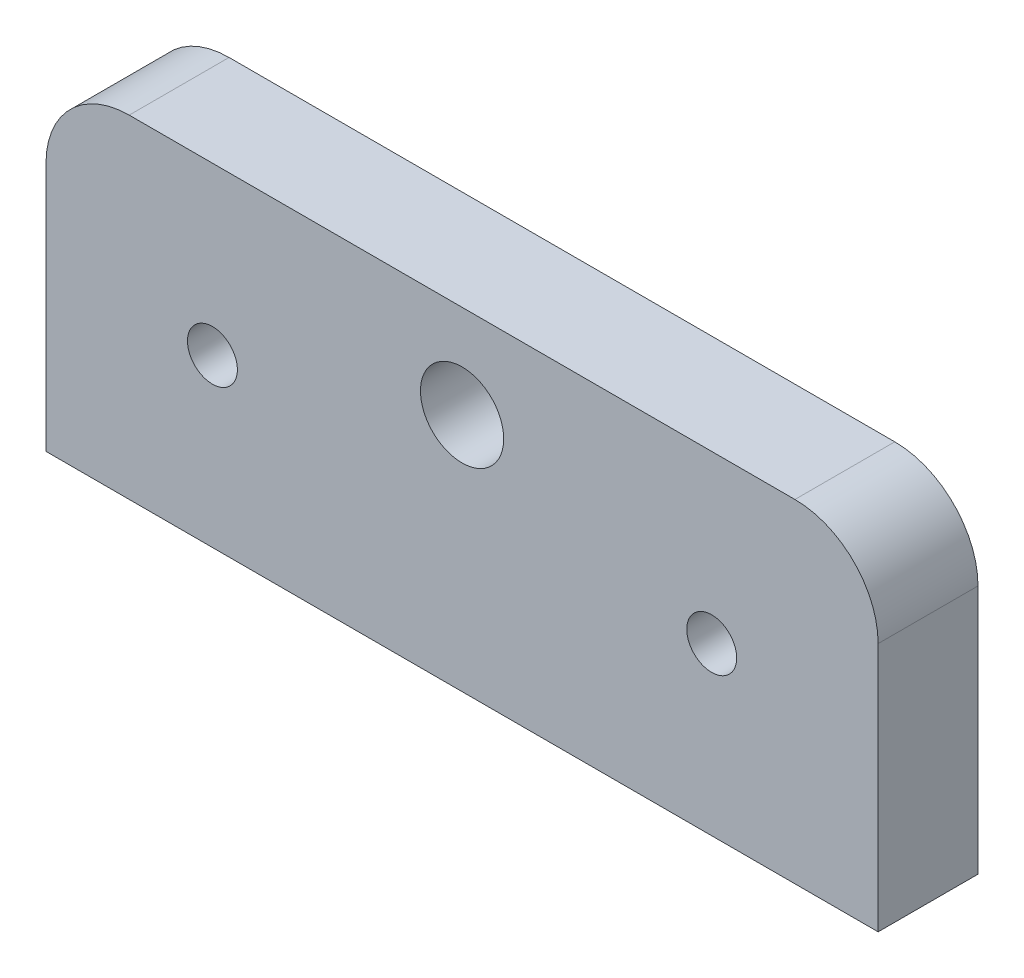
ISO-10303-21;
HEADER;
FILE_DESCRIPTION(('STEP AP214'),'2;1');
FILE_NAME('part.step','',(''),(''),'','','');
FILE_SCHEMA(('AUTOMOTIVE_DESIGN { 1 0 10303 214 1 1 1 1 }'));
ENDSEC;
DATA;
#1=APPLICATION_CONTEXT('core data for automotive mechanical design processes');
#2=APPLICATION_PROTOCOL_DEFINITION('international standard','automotive_design',2000,#1);
#3=PRODUCT_CONTEXT('',#1,'mechanical');
#4=PRODUCT('Part','Part','',(#3));
#5=PRODUCT_RELATED_PRODUCT_CATEGORY('part','',(#4));
#6=PRODUCT_DEFINITION_FORMATION('','',#4);
#7=PRODUCT_DEFINITION_CONTEXT('part definition',#1,'design');
#8=PRODUCT_DEFINITION('design','',#6,#7);
#9=PRODUCT_DEFINITION_SHAPE('','',#8);
#10=(LENGTH_UNIT() NAMED_UNIT(*) SI_UNIT(.MILLI.,.METRE.));
#11=(NAMED_UNIT(*) PLANE_ANGLE_UNIT() SI_UNIT($,.RADIAN.));
#12=(NAMED_UNIT(*) SI_UNIT($,.STERADIAN.) SOLID_ANGLE_UNIT());
#13=UNCERTAINTY_MEASURE_WITH_UNIT(LENGTH_MEASURE(1.E-05),#10,'distance_accuracy_value','');
#14=(GEOMETRIC_REPRESENTATION_CONTEXT(3) GLOBAL_UNCERTAINTY_ASSIGNED_CONTEXT((#13)) GLOBAL_UNIT_ASSIGNED_CONTEXT((#10,
#11,#12)) REPRESENTATION_CONTEXT('',''));
#15=CARTESIAN_POINT('',(0.,0.,0.));
#16=DIRECTION('',(0.,0.,1.));
#17=DIRECTION('',(1.,0.,0.));
#18=AXIS2_PLACEMENT_3D('',#15,#16,#17);
#19=CARTESIAN_POINT('',(-59.0386731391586,-15.868284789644,6.));
#20=DIRECTION('',(1.,0.,0.));
#21=DIRECTION('',(0.,1.,0.));
#22=AXIS2_PLACEMENT_3D('',#19,#20,#21);
#23=PLANE('',#22);
#24=DIRECTION('',(0.,-1.,0.));
#25=VECTOR('',#24,1.);
#26=CARTESIAN_POINT('',(-59.0386731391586,-15.868284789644,6.));
#27=LINE('',#26,#25);
#28=CARTESIAN_POINT('',(-59.0386731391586,-20.868284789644,6.));
#29=VERTEX_POINT('',#28);
#30=CARTESIAN_POINT('',(-59.0386731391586,-35.868284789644,6.));
#31=VERTEX_POINT('',#30);
#32=EDGE_CURVE('E137',#29,#31,#27,.T.);
#33=ORIENTED_EDGE('',*,*,#32,.F.);
#34=DIRECTION('',(0.,0.,-1.));
#35=VECTOR('',#34,1.);
#36=CARTESIAN_POINT('',(-59.0386731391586,-20.868284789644,6.));
#37=LINE('',#36,#35);
#38=CARTESIAN_POINT('',(-59.0386731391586,-20.868284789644,0.));
#39=VERTEX_POINT('',#38);
#40=EDGE_CURVE('E11',#29,#39,#37,.T.);
#41=ORIENTED_EDGE('',*,*,#40,.T.);
#42=DIRECTION('',(0.,-1.,0.));
#43=VECTOR('',#42,1.);
#44=CARTESIAN_POINT('',(-59.0386731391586,-15.868284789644,0.));
#45=LINE('',#44,#43);
#46=CARTESIAN_POINT('',(-59.0386731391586,-35.868284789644,0.));
#47=VERTEX_POINT('',#46);
#48=EDGE_CURVE('E87',#39,#47,#45,.T.);
#49=ORIENTED_EDGE('',*,*,#48,.T.);
#50=DIRECTION('',(0.,0.,-1.));
#51=VECTOR('',#50,1.);
#52=CARTESIAN_POINT('',(-59.0386731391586,-35.868284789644,6.));
#53=LINE('',#52,#51);
#54=EDGE_CURVE('E90',#31,#47,#53,.T.);
#55=ORIENTED_EDGE('',*,*,#54,.F.);
#56=EDGE_LOOP('',(#33,#41,#49,#55));
#57=FACE_BOUND('',#56,.T.);
#58=ADVANCED_FACE('F32',(#57),#23,.F.);
#59=CARTESIAN_POINT('',(-59.0386731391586,-35.868284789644,6.));
#60=DIRECTION('',(0.,1.,0.));
#61=DIRECTION('',(0.,0.,1.));
#62=AXIS2_PLACEMENT_3D('',#59,#60,#61);
#63=PLANE('',#62);
#64=DIRECTION('',(1.,0.,0.));
#65=VECTOR('',#64,1.);
#66=CARTESIAN_POINT('',(-59.0386731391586,-35.868284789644,0.));
#67=LINE('',#66,#65);
#68=CARTESIAN_POINT('',(-9.03867313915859,-35.868284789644,0.));
#69=VERTEX_POINT('',#68);
#70=EDGE_CURVE('E93',#47,#69,#67,.T.);
#71=ORIENTED_EDGE('',*,*,#70,.T.);
#72=DIRECTION('',(0.,0.,-1.));
#73=VECTOR('',#72,1.);
#74=CARTESIAN_POINT('',(-9.03867313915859,-35.868284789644,6.));
#75=LINE('',#74,#73);
#76=CARTESIAN_POINT('',(-9.03867313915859,-35.868284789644,6.));
#77=VERTEX_POINT('',#76);
#78=EDGE_CURVE('E108',#77,#69,#75,.T.);
#79=ORIENTED_EDGE('',*,*,#78,.F.);
#80=DIRECTION('',(1.,0.,0.));
#81=VECTOR('',#80,1.);
#82=CARTESIAN_POINT('',(-59.0386731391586,-35.868284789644,6.));
#83=LINE('',#82,#81);
#84=EDGE_CURVE('E106',#31,#77,#83,.T.);
#85=ORIENTED_EDGE('',*,*,#84,.F.);
#86=ORIENTED_EDGE('',*,*,#54,.T.);
#87=EDGE_LOOP('',(#71,#79,#85,#86));
#88=FACE_BOUND('',#87,.T.);
#89=ADVANCED_FACE('F105',(#88),#63,.F.);
#90=CARTESIAN_POINT('',(-9.03867313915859,-15.868284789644,6.));
#91=DIRECTION('',(-1.,0.,0.));
#92=DIRECTION('',(0.,0.,1.));
#93=AXIS2_PLACEMENT_3D('',#90,#91,#92);
#94=PLANE('',#93);
#95=DIRECTION('',(0.,1.,0.));
#96=VECTOR('',#95,1.);
#97=CARTESIAN_POINT('',(-9.03867313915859,-15.868284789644,0.));
#98=LINE('',#97,#96);
#99=CARTESIAN_POINT('',(-9.03867313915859,-20.868284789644,0.));
#100=VERTEX_POINT('',#99);
#101=EDGE_CURVE('E99',#69,#100,#98,.T.);
#102=ORIENTED_EDGE('',*,*,#101,.T.);
#103=DIRECTION('',(0.,0.,-1.));
#104=VECTOR('',#103,1.);
#105=CARTESIAN_POINT('',(-9.03867313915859,-20.868284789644,6.));
#106=LINE('',#105,#104);
#107=CARTESIAN_POINT('',(-9.03867313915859,-20.868284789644,6.));
#108=VERTEX_POINT('',#107);
#109=EDGE_CURVE('E54',#100,#108,#106,.F.);
#110=ORIENTED_EDGE('',*,*,#109,.T.);
#111=DIRECTION('',(0.,1.,0.));
#112=VECTOR('',#111,1.);
#113=CARTESIAN_POINT('',(-9.03867313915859,-15.868284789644,6.));
#114=LINE('',#113,#112);
#115=EDGE_CURVE('E126',#77,#108,#114,.T.);
#116=ORIENTED_EDGE('',*,*,#115,.F.);
#117=ORIENTED_EDGE('',*,*,#78,.T.);
#118=EDGE_LOOP('',(#102,#110,#116,#117));
#119=FACE_BOUND('',#118,.T.);
#120=ADVANCED_FACE('F135',(#119),#94,.F.);
#121=CARTESIAN_POINT('',(-59.0386731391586,-15.868284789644,6.));
#122=DIRECTION('',(0.,-1.,0.));
#123=DIRECTION('',(0.,0.,-1.));
#124=AXIS2_PLACEMENT_3D('',#121,#122,#123);
#125=PLANE('',#124);
#126=DIRECTION('',(-1.,0.,0.));
#127=VECTOR('',#126,1.);
#128=CARTESIAN_POINT('',(-59.0386731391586,-15.868284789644,6.));
#129=LINE('',#128,#127);
#130=CARTESIAN_POINT('',(-14.0386731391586,-15.868284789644,6.));
#131=VERTEX_POINT('',#130);
#132=CARTESIAN_POINT('',(-54.0386731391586,-15.868284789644,6.));
#133=VERTEX_POINT('',#132);
#134=EDGE_CURVE('E112',#131,#133,#129,.T.);
#135=ORIENTED_EDGE('',*,*,#134,.F.);
#136=DIRECTION('',(0.,0.,-1.));
#137=VECTOR('',#136,1.);
#138=CARTESIAN_POINT('',(-14.0386731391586,-15.868284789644,6.));
#139=LINE('',#138,#137);
#140=CARTESIAN_POINT('',(-14.0386731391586,-15.868284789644,0.));
#141=VERTEX_POINT('',#140);
#142=EDGE_CURVE('E110',#131,#141,#139,.T.);
#143=ORIENTED_EDGE('',*,*,#142,.T.);
#144=DIRECTION('',(-1.,0.,0.));
#145=VECTOR('',#144,1.);
#146=CARTESIAN_POINT('',(-59.0386731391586,-15.868284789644,0.));
#147=LINE('',#146,#145);
#148=CARTESIAN_POINT('',(-54.0386731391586,-15.868284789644,0.));
#149=VERTEX_POINT('',#148);
#150=EDGE_CURVE('E134',#141,#149,#147,.T.);
#151=ORIENTED_EDGE('',*,*,#150,.T.);
#152=DIRECTION('',(0.,0.,-1.));
#153=VECTOR('',#152,1.);
#154=CARTESIAN_POINT('',(-54.0386731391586,-15.868284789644,6.));
#155=LINE('',#154,#153);
#156=EDGE_CURVE('E107',#149,#133,#155,.F.);
#157=ORIENTED_EDGE('',*,*,#156,.T.);
#158=EDGE_LOOP('',(#135,#143,#151,#157));
#159=FACE_BOUND('',#158,.T.);
#160=ADVANCED_FACE('F130',(#159),#125,.F.);
#161=CARTESIAN_POINT('',(-59.0386731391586,-35.868284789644,6.));
#162=DIRECTION('',(0.,0.,1.));
#163=DIRECTION('',(1.,0.,0.));
#164=AXIS2_PLACEMENT_3D('',#161,#162,#163);
#165=PLANE('',#164);
#166=CARTESIAN_POINT('',(-49.0386731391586,-25.868284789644,6.));
#167=DIRECTION('',(0.,0.,1.));
#168=DIRECTION('',(1.,0.,0.));
#169=AXIS2_PLACEMENT_3D('',#166,#167,#168);
#170=CIRCLE('',#169,1.5);
#171=CARTESIAN_POINT('',(-47.5386731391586,-25.868284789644,6.));
#172=VERTEX_POINT('',#171);
#173=EDGE_CURVE('E186',#172,#172,#170,.T.);
#174=ORIENTED_EDGE('',*,*,#173,.F.);
#175=EDGE_LOOP('',(#174));
#176=FACE_BOUND('',#175,.T.);
#177=CARTESIAN_POINT('',(-19.0386731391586,-25.868284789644,6.));
#178=DIRECTION('',(0.,0.,1.));
#179=DIRECTION('',(1.,0.,0.));
#180=AXIS2_PLACEMENT_3D('',#177,#178,#179);
#181=CIRCLE('',#180,1.5);
#182=CARTESIAN_POINT('',(-17.5386731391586,-25.868284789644,6.));
#183=VERTEX_POINT('',#182);
#184=EDGE_CURVE('E188',#183,#183,#181,.T.);
#185=ORIENTED_EDGE('',*,*,#184,.F.);
#186=EDGE_LOOP('',(#185));
#187=FACE_BOUND('',#186,.T.);
#188=CARTESIAN_POINT('',(-34.0386731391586,-21.468284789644,6.));
#189=DIRECTION('',(0.,0.,1.));
#190=DIRECTION('',(1.,0.,0.));
#191=AXIS2_PLACEMENT_3D('',#188,#189,#190);
#192=CIRCLE('',#191,2.5);
#193=CARTESIAN_POINT('',(-31.5386731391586,-21.468284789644,6.));
#194=VERTEX_POINT('',#193);
#195=EDGE_CURVE('E196',#194,#194,#192,.T.);
#196=ORIENTED_EDGE('',*,*,#195,.F.);
#197=EDGE_LOOP('',(#196));
#198=FACE_BOUND('',#197,.T.);
#199=ORIENTED_EDGE('',*,*,#115,.T.);
#200=CARTESIAN_POINT('',(-14.0386731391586,-20.868284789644,6.));
#201=DIRECTION('',(0.,0.,1.));
#202=DIRECTION('',(1.,0.,0.));
#203=AXIS2_PLACEMENT_3D('',#200,#201,#202);
#204=CIRCLE('',#203,5.);
#205=EDGE_CURVE('E39',#108,#131,#204,.T.);
#206=ORIENTED_EDGE('',*,*,#205,.T.);
#207=ORIENTED_EDGE('',*,*,#134,.T.);
#208=CARTESIAN_POINT('',(-54.0386731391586,-20.868284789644,6.));
#209=DIRECTION('',(0.,0.,1.));
#210=DIRECTION('',(1.,0.,0.));
#211=AXIS2_PLACEMENT_3D('',#208,#209,#210);
#212=CIRCLE('',#211,5.);
#213=EDGE_CURVE('E46',#133,#29,#212,.T.);
#214=ORIENTED_EDGE('',*,*,#213,.T.);
#215=ORIENTED_EDGE('',*,*,#32,.T.);
#216=ORIENTED_EDGE('',*,*,#84,.T.);
#217=EDGE_LOOP('',(#199,#206,#207,#214,#215,#216));
#218=FACE_BOUND('',#217,.T.);
#219=ADVANCED_FACE('F125',(#176,#187,#198,#218),#165,.T.);
#220=CARTESIAN_POINT('',(-59.0386731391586,-35.868284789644,0.));
#221=DIRECTION('',(0.,0.,1.));
#222=DIRECTION('',(1.,0.,0.));
#223=AXIS2_PLACEMENT_3D('',#220,#221,#222);
#224=PLANE('',#223);
#225=CARTESIAN_POINT('',(-49.0386731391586,-25.868284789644,0.));
#226=DIRECTION('',(0.,0.,1.));
#227=DIRECTION('',(1.,0.,0.));
#228=AXIS2_PLACEMENT_3D('',#225,#226,#227);
#229=CIRCLE('',#228,1.5);
#230=CARTESIAN_POINT('',(-47.5386731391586,-25.868284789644,0.));
#231=VERTEX_POINT('',#230);
#232=EDGE_CURVE('E183',#231,#231,#229,.T.);
#233=ORIENTED_EDGE('',*,*,#232,.T.);
#234=EDGE_LOOP('',(#233));
#235=FACE_BOUND('',#234,.T.);
#236=CARTESIAN_POINT('',(-19.0386731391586,-25.868284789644,0.));
#237=DIRECTION('',(0.,0.,1.));
#238=DIRECTION('',(1.,0.,0.));
#239=AXIS2_PLACEMENT_3D('',#236,#237,#238);
#240=CIRCLE('',#239,1.5);
#241=CARTESIAN_POINT('',(-17.5386731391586,-25.868284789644,0.));
#242=VERTEX_POINT('',#241);
#243=EDGE_CURVE('E193',#242,#242,#240,.T.);
#244=ORIENTED_EDGE('',*,*,#243,.T.);
#245=EDGE_LOOP('',(#244));
#246=FACE_BOUND('',#245,.T.);
#247=CARTESIAN_POINT('',(-34.0386731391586,-21.468284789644,0.));
#248=DIRECTION('',(0.,0.,1.));
#249=DIRECTION('',(1.,0.,0.));
#250=AXIS2_PLACEMENT_3D('',#247,#248,#249);
#251=CIRCLE('',#250,2.5);
#252=CARTESIAN_POINT('',(-31.5386731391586,-21.468284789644,0.));
#253=VERTEX_POINT('',#252);
#254=EDGE_CURVE('E94',#253,#253,#251,.T.);
#255=ORIENTED_EDGE('',*,*,#254,.T.);
#256=EDGE_LOOP('',(#255));
#257=FACE_BOUND('',#256,.T.);
#258=ORIENTED_EDGE('',*,*,#150,.F.);
#259=CARTESIAN_POINT('',(-14.0386731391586,-20.868284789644,0.));
#260=DIRECTION('',(0.,0.,1.));
#261=DIRECTION('',(1.,0.,0.));
#262=AXIS2_PLACEMENT_3D('',#259,#260,#261);
#263=CIRCLE('',#262,5.);
#264=EDGE_CURVE('E120',#141,#100,#263,.F.);
#265=ORIENTED_EDGE('',*,*,#264,.T.);
#266=ORIENTED_EDGE('',*,*,#101,.F.);
#267=ORIENTED_EDGE('',*,*,#70,.F.);
#268=ORIENTED_EDGE('',*,*,#48,.F.);
#269=CARTESIAN_POINT('',(-54.0386731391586,-20.868284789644,0.));
#270=DIRECTION('',(0.,0.,1.));
#271=DIRECTION('',(1.,0.,0.));
#272=AXIS2_PLACEMENT_3D('',#269,#270,#271);
#273=CIRCLE('',#272,5.);
#274=EDGE_CURVE('E118',#39,#149,#273,.F.);
#275=ORIENTED_EDGE('',*,*,#274,.T.);
#276=EDGE_LOOP('',(#258,#265,#266,#267,#268,#275));
#277=FACE_BOUND('',#276,.T.);
#278=ADVANCED_FACE('F98',(#235,#246,#257,#277),#224,.F.);
#279=CARTESIAN_POINT('',(-34.0386731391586,-21.468284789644,0.));
#280=DIRECTION('',(0.,0.,1.));
#281=DIRECTION('',(1.,0.,0.));
#282=AXIS2_PLACEMENT_3D('',#279,#280,#281);
#283=CYLINDRICAL_SURFACE('',#282,2.5);
#284=ORIENTED_EDGE('',*,*,#254,.F.);
#285=EDGE_LOOP('',(#284));
#286=FACE_BOUND('',#285,.T.);
#287=ORIENTED_EDGE('',*,*,#195,.T.);
#288=EDGE_LOOP('',(#287));
#289=FACE_BOUND('',#288,.T.);
#290=ADVANCED_FACE('F167',(#286,#289),#283,.F.);
#291=CARTESIAN_POINT('',(-19.0386731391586,-25.868284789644,0.));
#292=DIRECTION('',(0.,0.,1.));
#293=DIRECTION('',(1.,0.,0.));
#294=AXIS2_PLACEMENT_3D('',#291,#292,#293);
#295=CYLINDRICAL_SURFACE('',#294,1.5);
#296=ORIENTED_EDGE('',*,*,#243,.F.);
#297=EDGE_LOOP('',(#296));
#298=FACE_BOUND('',#297,.T.);
#299=ORIENTED_EDGE('',*,*,#184,.T.);
#300=EDGE_LOOP('',(#299));
#301=FACE_BOUND('',#300,.T.);
#302=ADVANCED_FACE('F171',(#298,#301),#295,.F.);
#303=CARTESIAN_POINT('',(-49.0386731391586,-25.868284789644,0.));
#304=DIRECTION('',(0.,0.,1.));
#305=DIRECTION('',(1.,0.,0.));
#306=AXIS2_PLACEMENT_3D('',#303,#304,#305);
#307=CYLINDRICAL_SURFACE('',#306,1.5);
#308=ORIENTED_EDGE('',*,*,#232,.F.);
#309=EDGE_LOOP('',(#308));
#310=FACE_BOUND('',#309,.T.);
#311=ORIENTED_EDGE('',*,*,#173,.T.);
#312=EDGE_LOOP('',(#311));
#313=FACE_BOUND('',#312,.T.);
#314=ADVANCED_FACE('F149',(#310,#313),#307,.F.);
#315=CARTESIAN_POINT('',(-14.0386731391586,-20.868284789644,6.));
#316=DIRECTION('',(0.,0.,-1.));
#317=DIRECTION('',(-1.,0.,0.));
#318=AXIS2_PLACEMENT_3D('',#315,#316,#317);
#319=CYLINDRICAL_SURFACE('',#318,5.);
#320=ORIENTED_EDGE('',*,*,#205,.F.);
#321=ORIENTED_EDGE('',*,*,#109,.F.);
#322=ORIENTED_EDGE('',*,*,#264,.F.);
#323=ORIENTED_EDGE('',*,*,#142,.F.);
#324=EDGE_LOOP('',(#320,#321,#322,#323));
#325=FACE_BOUND('',#324,.T.);
#326=ADVANCED_FACE('F133',(#325),#319,.T.);
#327=CARTESIAN_POINT('',(-54.0386731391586,-20.868284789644,6.));
#328=DIRECTION('',(0.,0.,-1.));
#329=DIRECTION('',(-1.,0.,0.));
#330=AXIS2_PLACEMENT_3D('',#327,#328,#329);
#331=CYLINDRICAL_SURFACE('',#330,5.);
#332=ORIENTED_EDGE('',*,*,#213,.F.);
#333=ORIENTED_EDGE('',*,*,#156,.F.);
#334=ORIENTED_EDGE('',*,*,#274,.F.);
#335=ORIENTED_EDGE('',*,*,#40,.F.);
#336=EDGE_LOOP('',(#332,#333,#334,#335));
#337=FACE_BOUND('',#336,.T.);
#338=ADVANCED_FACE('F143',(#337),#331,.T.);
#339=CLOSED_SHELL('',(#58,#89,#120,#160,#219,#278,#290,#302,#314,#326,#338));
#340=MANIFOLD_SOLID_BREP('B2',#339);
#341=ADVANCED_BREP_SHAPE_REPRESENTATION('',(#18,#340),#14);
#342=SHAPE_DEFINITION_REPRESENTATION(#9,#341);
ENDSEC;
END-ISO-10303-21;
